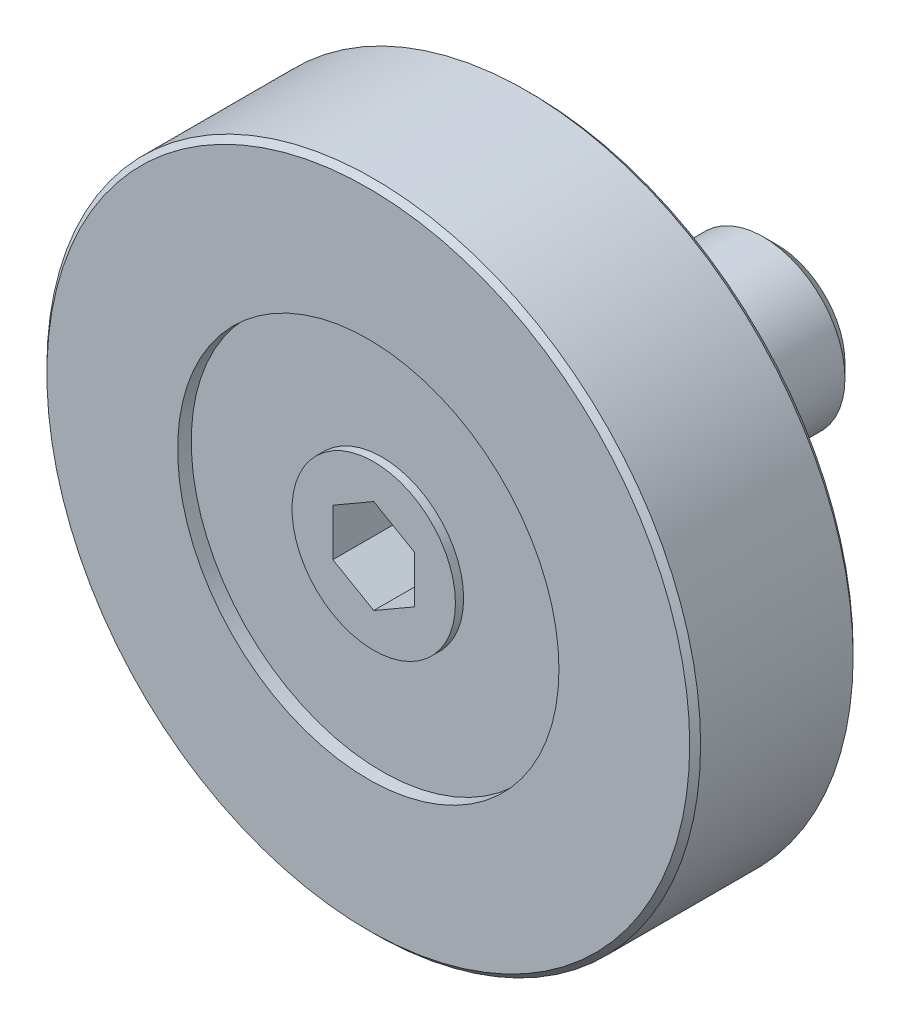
ISO-10303-21;
HEADER;
FILE_DESCRIPTION(('STEP AP214'),'2;1');
FILE_NAME('part.step','',(''),(''),'','','');
FILE_SCHEMA(('AUTOMOTIVE_DESIGN { 1 0 10303 214 1 1 1 1 }'));
ENDSEC;
DATA;
#1=APPLICATION_CONTEXT('core data for automotive mechanical design processes');
#2=APPLICATION_PROTOCOL_DEFINITION('international standard','automotive_design',2000,#1);
#3=PRODUCT_CONTEXT('',#1,'mechanical');
#4=PRODUCT('Part','Part','',(#3));
#5=PRODUCT_RELATED_PRODUCT_CATEGORY('part','',(#4));
#6=PRODUCT_DEFINITION_FORMATION('','',#4);
#7=PRODUCT_DEFINITION_CONTEXT('part definition',#1,'design');
#8=PRODUCT_DEFINITION('design','',#6,#7);
#9=PRODUCT_DEFINITION_SHAPE('','',#8);
#10=(LENGTH_UNIT() NAMED_UNIT(*) SI_UNIT(.MILLI.,.METRE.));
#11=(NAMED_UNIT(*) PLANE_ANGLE_UNIT() SI_UNIT($,.RADIAN.));
#12=(NAMED_UNIT(*) SI_UNIT($,.STERADIAN.) SOLID_ANGLE_UNIT());
#13=UNCERTAINTY_MEASURE_WITH_UNIT(LENGTH_MEASURE(1.E-05),#10,'distance_accuracy_value','');
#14=(GEOMETRIC_REPRESENTATION_CONTEXT(3) GLOBAL_UNCERTAINTY_ASSIGNED_CONTEXT((#13)) GLOBAL_UNIT_ASSIGNED_CONTEXT((#10,
#11,#12)) REPRESENTATION_CONTEXT('',''));
#15=CARTESIAN_POINT('',(0.,0.,0.));
#16=DIRECTION('',(0.,0.,1.));
#17=DIRECTION('',(1.,0.,0.));
#18=AXIS2_PLACEMENT_3D('',#15,#16,#17);
#19=CARTESIAN_POINT('',(0.,0.,-8.00000000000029));
#20=DIRECTION('',(0.,0.,1.));
#21=DIRECTION('',(1.,0.,0.));
#22=AXIS2_PLACEMENT_3D('',#19,#20,#21);
#23=PLANE('',#22);
#24=CARTESIAN_POINT('',(0.,0.,-8.00000000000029));
#25=DIRECTION('',(0.,0.,1.));
#26=DIRECTION('',(1.,0.,0.));
#27=AXIS2_PLACEMENT_3D('',#24,#25,#26);
#28=CIRCLE('',#27,2.49999999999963);
#29=CARTESIAN_POINT('',(2.49999999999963,0.,-8.00000000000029));
#30=VERTEX_POINT('',#29);
#31=EDGE_CURVE('E9',#30,#30,#28,.T.);
#32=ORIENTED_EDGE('',*,*,#31,.F.);
#33=EDGE_LOOP('',(#32));
#34=FACE_BOUND('',#33,.T.);
#35=ADVANCED_FACE('F14',(#34),#23,.F.);
#36=CARTESIAN_POINT('',(0.,0.,-8.00000000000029));
#37=DIRECTION('',(0.,0.,1.));
#38=DIRECTION('',(1.,0.,0.));
#39=AXIS2_PLACEMENT_3D('',#36,#37,#38);
#40=CONICAL_SURFACE('',#39,2.49999999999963,0.785398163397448);
#41=CARTESIAN_POINT('',(0.,0.,-7.50000000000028));
#42=DIRECTION('',(0.,0.,1.));
#43=DIRECTION('',(1.,0.,0.));
#44=AXIS2_PLACEMENT_3D('',#41,#42,#43);
#45=CIRCLE('',#44,2.99999999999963);
#46=CARTESIAN_POINT('',(2.99999999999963,0.,-7.50000000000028));
#47=VERTEX_POINT('',#46);
#48=EDGE_CURVE('E21',#47,#47,#45,.T.);
#49=ORIENTED_EDGE('',*,*,#48,.F.);
#50=EDGE_LOOP('',(#49));
#51=FACE_BOUND('',#50,.T.);
#52=ORIENTED_EDGE('',*,*,#31,.T.);
#53=EDGE_LOOP('',(#52));
#54=FACE_BOUND('',#53,.T.);
#55=ADVANCED_FACE('F169',(#51,#54),#40,.T.);
#56=CARTESIAN_POINT('',(0.,0.,10.));
#57=DIRECTION('',(0.,0.,1.));
#58=DIRECTION('',(1.,0.,0.));
#59=AXIS2_PLACEMENT_3D('',#56,#57,#58);
#60=CYLINDRICAL_SURFACE('',#59,2.99999999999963);
#61=CARTESIAN_POINT('',(0.,0.,-2.00000000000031));
#62=DIRECTION('',(0.,0.,1.));
#63=DIRECTION('',(1.,0.,0.));
#64=AXIS2_PLACEMENT_3D('',#61,#62,#63);
#65=CIRCLE('',#64,2.99999999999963);
#66=CARTESIAN_POINT('',(2.99999999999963,0.,-2.00000000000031));
#67=VERTEX_POINT('',#66);
#68=EDGE_CURVE('E162',#67,#67,#65,.T.);
#69=ORIENTED_EDGE('',*,*,#68,.F.);
#70=EDGE_LOOP('',(#69));
#71=FACE_BOUND('',#70,.T.);
#72=ORIENTED_EDGE('',*,*,#48,.T.);
#73=EDGE_LOOP('',(#72));
#74=FACE_BOUND('',#73,.T.);
#75=ADVANCED_FACE('F167',(#71,#74),#60,.T.);
#76=CARTESIAN_POINT('',(0.,2.34999999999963,-2.00000000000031));
#77=DIRECTION('',(0.,0.,-1.));
#78=DIRECTION('',(-1.,0.,0.));
#79=AXIS2_PLACEMENT_3D('',#76,#77,#78);
#80=PLANE('',#79);
#81=CARTESIAN_POINT('',(0.,0.,-2.00000000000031));
#82=DIRECTION('',(0.,0.,1.));
#83=DIRECTION('',(1.,0.,0.));
#84=AXIS2_PLACEMENT_3D('',#81,#82,#83);
#85=CIRCLE('',#84,2.34999999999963);
#86=CARTESIAN_POINT('',(2.34999999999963,0.,-2.00000000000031));
#87=VERTEX_POINT('',#86);
#88=EDGE_CURVE('E159',#87,#87,#85,.T.);
#89=ORIENTED_EDGE('',*,*,#88,.F.);
#90=EDGE_LOOP('',(#89));
#91=FACE_BOUND('',#90,.T.);
#92=ORIENTED_EDGE('',*,*,#68,.T.);
#93=EDGE_LOOP('',(#92));
#94=FACE_BOUND('',#93,.T.);
#95=ADVANCED_FACE('F194',(#91,#94),#80,.F.);
#96=CARTESIAN_POINT('',(0.,0.,10.));
#97=DIRECTION('',(0.,0.,1.));
#98=DIRECTION('',(1.,0.,0.));
#99=AXIS2_PLACEMENT_3D('',#96,#97,#98);
#100=CYLINDRICAL_SURFACE('',#99,2.34999999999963);
#101=CARTESIAN_POINT('',(0.,0.,-3.05311331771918E-13));
#102=DIRECTION('',(0.,0.,1.));
#103=DIRECTION('',(1.,0.,0.));
#104=AXIS2_PLACEMENT_3D('',#101,#102,#103);
#105=CIRCLE('',#104,2.34999999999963);
#106=CARTESIAN_POINT('',(2.34999999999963,0.,-3.05311331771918E-13));
#107=VERTEX_POINT('',#106);
#108=EDGE_CURVE('E156',#107,#107,#105,.T.);
#109=ORIENTED_EDGE('',*,*,#108,.F.);
#110=EDGE_LOOP('',(#109));
#111=FACE_BOUND('',#110,.T.);
#112=ORIENTED_EDGE('',*,*,#88,.T.);
#113=EDGE_LOOP('',(#112));
#114=FACE_BOUND('',#113,.T.);
#115=ADVANCED_FACE('F203',(#111,#114),#100,.T.);
#116=CARTESIAN_POINT('',(0.,3.99999999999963,-3.05311331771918E-13));
#117=DIRECTION('',(0.,0.,1.));
#118=DIRECTION('',(1.,0.,0.));
#119=AXIS2_PLACEMENT_3D('',#116,#117,#118);
#120=PLANE('',#119);
#121=CARTESIAN_POINT('',(0.,0.,-3.05311331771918E-13));
#122=DIRECTION('',(0.,0.,1.));
#123=DIRECTION('',(1.,0.,0.));
#124=AXIS2_PLACEMENT_3D('',#121,#122,#123);
#125=CIRCLE('',#124,3.99999999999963);
#126=CARTESIAN_POINT('',(3.99999999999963,0.,-3.05311331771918E-13));
#127=VERTEX_POINT('',#126);
#128=EDGE_CURVE('E153',#127,#127,#125,.T.);
#129=ORIENTED_EDGE('',*,*,#128,.F.);
#130=EDGE_LOOP('',(#129));
#131=FACE_BOUND('',#130,.T.);
#132=ORIENTED_EDGE('',*,*,#108,.T.);
#133=EDGE_LOOP('',(#132));
#134=FACE_BOUND('',#133,.T.);
#135=ADVANCED_FACE('F212',(#131,#134),#120,.F.);
#136=CARTESIAN_POINT('',(0.,0.,10.));
#137=DIRECTION('',(0.,0.,1.));
#138=DIRECTION('',(1.,0.,0.));
#139=AXIS2_PLACEMENT_3D('',#136,#137,#138);
#140=CYLINDRICAL_SURFACE('',#139,3.99999999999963);
#141=CARTESIAN_POINT('',(0.,0.,1.49999999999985));
#142=DIRECTION('',(0.,0.,1.));
#143=DIRECTION('',(1.,0.,0.));
#144=AXIS2_PLACEMENT_3D('',#141,#142,#143);
#145=CIRCLE('',#144,3.99999999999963);
#146=CARTESIAN_POINT('',(3.99999999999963,0.,1.49999999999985));
#147=VERTEX_POINT('',#146);
#148=EDGE_CURVE('E150',#147,#147,#145,.T.);
#149=ORIENTED_EDGE('',*,*,#148,.F.);
#150=EDGE_LOOP('',(#149));
#151=FACE_BOUND('',#150,.T.);
#152=ORIENTED_EDGE('',*,*,#128,.T.);
#153=EDGE_LOOP('',(#152));
#154=FACE_BOUND('',#153,.T.);
#155=ADVANCED_FACE('F221',(#151,#154),#140,.T.);
#156=CARTESIAN_POINT('',(0.,3.99999999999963,1.49999999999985));
#157=DIRECTION('',(0.,0.,1.));
#158=DIRECTION('',(1.,0.,0.));
#159=AXIS2_PLACEMENT_3D('',#156,#157,#158);
#160=PLANE('',#159);
#161=CARTESIAN_POINT('',(0.,0.,1.49999999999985));
#162=DIRECTION('',(0.,0.,1.));
#163=DIRECTION('',(1.,0.,0.));
#164=AXIS2_PLACEMENT_3D('',#161,#162,#163);
#165=CIRCLE('',#164,6.99999999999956);
#166=CARTESIAN_POINT('',(6.99999999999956,0.,1.49999999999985));
#167=VERTEX_POINT('',#166);
#168=EDGE_CURVE('E147',#167,#167,#165,.T.);
#169=ORIENTED_EDGE('',*,*,#168,.F.);
#170=EDGE_LOOP('',(#169));
#171=FACE_BOUND('',#170,.T.);
#172=ORIENTED_EDGE('',*,*,#148,.T.);
#173=EDGE_LOOP('',(#172));
#174=FACE_BOUND('',#173,.T.);
#175=ADVANCED_FACE('F230',(#171,#174),#160,.F.);
#176=CARTESIAN_POINT('',(0.,0.,10.));
#177=DIRECTION('',(0.,0.,1.));
#178=DIRECTION('',(1.,0.,0.));
#179=AXIS2_PLACEMENT_3D('',#176,#177,#178);
#180=CYLINDRICAL_SURFACE('',#179,6.99999999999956);
#181=CARTESIAN_POINT('',(0.,0.,0.999999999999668));
#182=DIRECTION('',(0.,0.,1.));
#183=DIRECTION('',(1.,0.,0.));
#184=AXIS2_PLACEMENT_3D('',#181,#182,#183);
#185=CIRCLE('',#184,6.99999999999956);
#186=CARTESIAN_POINT('',(6.99999999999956,0.,0.999999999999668));
#187=VERTEX_POINT('',#186);
#188=EDGE_CURVE('E144',#187,#187,#185,.T.);
#189=ORIENTED_EDGE('',*,*,#188,.F.);
#190=EDGE_LOOP('',(#189));
#191=FACE_BOUND('',#190,.T.);
#192=ORIENTED_EDGE('',*,*,#168,.T.);
#193=EDGE_LOOP('',(#192));
#194=FACE_BOUND('',#193,.T.);
#195=ADVANCED_FACE('F239',(#191,#194),#180,.F.);
#196=CARTESIAN_POINT('',(0.,11.8,0.999999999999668));
#197=DIRECTION('',(0.,0.,1.));
#198=DIRECTION('',(1.,0.,0.));
#199=AXIS2_PLACEMENT_3D('',#196,#197,#198);
#200=PLANE('',#199);
#201=CARTESIAN_POINT('',(0.,0.,0.999999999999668));
#202=DIRECTION('',(0.,0.,1.));
#203=DIRECTION('',(1.,0.,0.));
#204=AXIS2_PLACEMENT_3D('',#201,#202,#203);
#205=CIRCLE('',#204,11.8);
#206=CARTESIAN_POINT('',(11.8,0.,0.999999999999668));
#207=VERTEX_POINT('',#206);
#208=EDGE_CURVE('E141',#207,#207,#205,.T.);
#209=ORIENTED_EDGE('',*,*,#208,.F.);
#210=EDGE_LOOP('',(#209));
#211=FACE_BOUND('',#210,.T.);
#212=ORIENTED_EDGE('',*,*,#188,.T.);
#213=EDGE_LOOP('',(#212));
#214=FACE_BOUND('',#213,.T.);
#215=ADVANCED_FACE('F248',(#211,#214),#200,.F.);
#216=CARTESIAN_POINT('',(0.,0.,0.999999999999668));
#217=DIRECTION('',(0.,0.,1.));
#218=DIRECTION('',(1.,0.,0.));
#219=AXIS2_PLACEMENT_3D('',#216,#217,#218);
#220=CONICAL_SURFACE('',#219,11.8,0.785398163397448);
#221=CARTESIAN_POINT('',(0.,0.,1.19999999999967));
#222=DIRECTION('',(0.,0.,1.));
#223=DIRECTION('',(1.,0.,0.));
#224=AXIS2_PLACEMENT_3D('',#221,#222,#223);
#225=CIRCLE('',#224,12.);
#226=CARTESIAN_POINT('',(12.,0.,1.19999999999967));
#227=VERTEX_POINT('',#226);
#228=EDGE_CURVE('E138',#227,#227,#225,.T.);
#229=ORIENTED_EDGE('',*,*,#228,.F.);
#230=EDGE_LOOP('',(#229));
#231=FACE_BOUND('',#230,.T.);
#232=ORIENTED_EDGE('',*,*,#208,.T.);
#233=EDGE_LOOP('',(#232));
#234=FACE_BOUND('',#233,.T.);
#235=ADVANCED_FACE('F257',(#231,#234),#220,.T.);
#236=CARTESIAN_POINT('',(0.,0.,10.));
#237=DIRECTION('',(0.,0.,1.));
#238=DIRECTION('',(1.,0.,0.));
#239=AXIS2_PLACEMENT_3D('',#236,#237,#238);
#240=CYLINDRICAL_SURFACE('',#239,12.);
#241=CARTESIAN_POINT('',(0.,0.,6.8));
#242=DIRECTION('',(0.,0.,1.));
#243=DIRECTION('',(1.,0.,0.));
#244=AXIS2_PLACEMENT_3D('',#241,#242,#243);
#245=CIRCLE('',#244,12.);
#246=CARTESIAN_POINT('',(12.,0.,6.8));
#247=VERTEX_POINT('',#246);
#248=EDGE_CURVE('E135',#247,#247,#245,.T.);
#249=ORIENTED_EDGE('',*,*,#248,.F.);
#250=EDGE_LOOP('',(#249));
#251=FACE_BOUND('',#250,.T.);
#252=ORIENTED_EDGE('',*,*,#228,.T.);
#253=EDGE_LOOP('',(#252));
#254=FACE_BOUND('',#253,.T.);
#255=ADVANCED_FACE('F266',(#251,#254),#240,.T.);
#256=CARTESIAN_POINT('',(0.,0.,6.8));
#257=DIRECTION('',(0.,0.,-1.));
#258=DIRECTION('',(-1.,0.,0.));
#259=AXIS2_PLACEMENT_3D('',#256,#257,#258);
#260=CONICAL_SURFACE('',#259,12.,0.78539816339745);
#261=CARTESIAN_POINT('',(0.,0.,7.));
#262=DIRECTION('',(0.,0.,1.));
#263=DIRECTION('',(1.,0.,0.));
#264=AXIS2_PLACEMENT_3D('',#261,#262,#263);
#265=CIRCLE('',#264,11.8);
#266=CARTESIAN_POINT('',(11.8,0.,7.));
#267=VERTEX_POINT('',#266);
#268=EDGE_CURVE('E132',#267,#267,#265,.T.);
#269=ORIENTED_EDGE('',*,*,#268,.F.);
#270=EDGE_LOOP('',(#269));
#271=FACE_BOUND('',#270,.T.);
#272=ORIENTED_EDGE('',*,*,#248,.T.);
#273=EDGE_LOOP('',(#272));
#274=FACE_BOUND('',#273,.T.);
#275=ADVANCED_FACE('F275',(#271,#274),#260,.T.);
#276=CARTESIAN_POINT('',(0.,11.8,7.));
#277=DIRECTION('',(0.,0.,-1.));
#278=DIRECTION('',(-1.,0.,0.));
#279=AXIS2_PLACEMENT_3D('',#276,#277,#278);
#280=PLANE('',#279);
#281=CARTESIAN_POINT('',(0.,0.,7.));
#282=DIRECTION('',(0.,0.,1.));
#283=DIRECTION('',(1.,0.,0.));
#284=AXIS2_PLACEMENT_3D('',#281,#282,#283);
#285=CIRCLE('',#284,6.99999999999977);
#286=CARTESIAN_POINT('',(6.99999999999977,0.,7.));
#287=VERTEX_POINT('',#286);
#288=EDGE_CURVE('E129',#287,#287,#285,.T.);
#289=ORIENTED_EDGE('',*,*,#288,.F.);
#290=EDGE_LOOP('',(#289));
#291=FACE_BOUND('',#290,.T.);
#292=ORIENTED_EDGE('',*,*,#268,.T.);
#293=EDGE_LOOP('',(#292));
#294=FACE_BOUND('',#293,.T.);
#295=ADVANCED_FACE('F284',(#291,#294),#280,.F.);
#296=CARTESIAN_POINT('',(0.,0.,10.));
#297=DIRECTION('',(0.,0.,1.));
#298=DIRECTION('',(1.,0.,0.));
#299=AXIS2_PLACEMENT_3D('',#296,#297,#298);
#300=CYLINDRICAL_SURFACE('',#299,6.99999999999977);
#301=CARTESIAN_POINT('',(0.,0.,6.5));
#302=DIRECTION('',(0.,0.,1.));
#303=DIRECTION('',(1.,0.,0.));
#304=AXIS2_PLACEMENT_3D('',#301,#302,#303);
#305=CIRCLE('',#304,6.99999999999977);
#306=CARTESIAN_POINT('',(6.99999999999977,0.,6.5));
#307=VERTEX_POINT('',#306);
#308=EDGE_CURVE('E126',#307,#307,#305,.T.);
#309=ORIENTED_EDGE('',*,*,#308,.F.);
#310=EDGE_LOOP('',(#309));
#311=FACE_BOUND('',#310,.T.);
#312=ORIENTED_EDGE('',*,*,#288,.T.);
#313=EDGE_LOOP('',(#312));
#314=FACE_BOUND('',#313,.T.);
#315=ADVANCED_FACE('F293',(#311,#314),#300,.F.);
#316=CARTESIAN_POINT('',(0.,3.,6.5));
#317=DIRECTION('',(0.,0.,-1.));
#318=DIRECTION('',(-1.,0.,0.));
#319=AXIS2_PLACEMENT_3D('',#316,#317,#318);
#320=PLANE('',#319);
#321=CARTESIAN_POINT('',(0.,0.,6.5));
#322=DIRECTION('',(0.,0.,1.));
#323=DIRECTION('',(1.,0.,0.));
#324=AXIS2_PLACEMENT_3D('',#321,#322,#323);
#325=CIRCLE('',#324,3.);
#326=CARTESIAN_POINT('',(3.,0.,6.5));
#327=VERTEX_POINT('',#326);
#328=EDGE_CURVE('E123',#327,#327,#325,.T.);
#329=ORIENTED_EDGE('',*,*,#328,.F.);
#330=EDGE_LOOP('',(#329));
#331=FACE_BOUND('',#330,.T.);
#332=ORIENTED_EDGE('',*,*,#308,.T.);
#333=EDGE_LOOP('',(#332));
#334=FACE_BOUND('',#333,.T.);
#335=ADVANCED_FACE('F302',(#331,#334),#320,.F.);
#336=CARTESIAN_POINT('',(0.,0.,10.));
#337=DIRECTION('',(0.,0.,1.));
#338=DIRECTION('',(1.,0.,0.));
#339=AXIS2_PLACEMENT_3D('',#336,#337,#338);
#340=CYLINDRICAL_SURFACE('',#339,3.);
#341=CARTESIAN_POINT('',(0.,0.,6.8));
#342=DIRECTION('',(0.,0.,1.));
#343=DIRECTION('',(1.,0.,0.));
#344=AXIS2_PLACEMENT_3D('',#341,#342,#343);
#345=CIRCLE('',#344,3.);
#346=CARTESIAN_POINT('',(3.,0.,6.8));
#347=VERTEX_POINT('',#346);
#348=EDGE_CURVE('E115',#347,#347,#345,.T.);
#349=ORIENTED_EDGE('',*,*,#348,.F.);
#350=EDGE_LOOP('',(#349));
#351=FACE_BOUND('',#350,.T.);
#352=ORIENTED_EDGE('',*,*,#328,.T.);
#353=EDGE_LOOP('',(#352));
#354=FACE_BOUND('',#353,.T.);
#355=ADVANCED_FACE('F311',(#351,#354),#340,.T.);
#356=CARTESIAN_POINT('',(0.,3.,6.8));
#357=DIRECTION('',(0.,0.,-1.));
#358=DIRECTION('',(-1.,0.,0.));
#359=AXIS2_PLACEMENT_3D('',#356,#357,#358);
#360=PLANE('',#359);
#361=DIRECTION('',(-0.866025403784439,-0.5,0.));
#362=VECTOR('',#361,1.);
#363=CARTESIAN_POINT('',(0.,1.73205080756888,6.8));
#364=LINE('',#363,#362);
#365=CARTESIAN_POINT('',(0.,1.73205080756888,6.8));
#366=VERTEX_POINT('',#365);
#367=CARTESIAN_POINT('',(-1.5,0.86602540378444,6.8));
#368=VERTEX_POINT('',#367);
#369=EDGE_CURVE('E102',#366,#368,#364,.T.);
#370=ORIENTED_EDGE('',*,*,#369,.F.);
#371=DIRECTION('',(-0.866025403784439,0.5,0.));
#372=VECTOR('',#371,1.);
#373=CARTESIAN_POINT('',(1.5,0.86602540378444,6.8));
#374=LINE('',#373,#372);
#375=CARTESIAN_POINT('',(1.5,0.86602540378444,6.8));
#376=VERTEX_POINT('',#375);
#377=EDGE_CURVE('E28',#376,#366,#374,.T.);
#378=ORIENTED_EDGE('',*,*,#377,.F.);
#379=DIRECTION('',(0.,1.,0.));
#380=VECTOR('',#379,1.);
#381=CARTESIAN_POINT('',(1.5,-0.866025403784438,6.8));
#382=LINE('',#381,#380);
#383=CARTESIAN_POINT('',(1.5,-0.866025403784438,6.8));
#384=VERTEX_POINT('',#383);
#385=EDGE_CURVE('E111',#384,#376,#382,.T.);
#386=ORIENTED_EDGE('',*,*,#385,.F.);
#387=DIRECTION('',(0.866025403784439,0.5,0.));
#388=VECTOR('',#387,1.);
#389=CARTESIAN_POINT('',(0.,-1.73205080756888,6.8));
#390=LINE('',#389,#388);
#391=CARTESIAN_POINT('',(0.,-1.73205080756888,6.8));
#392=VERTEX_POINT('',#391);
#393=EDGE_CURVE('E109',#392,#384,#390,.T.);
#394=ORIENTED_EDGE('',*,*,#393,.F.);
#395=DIRECTION('',(0.866025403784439,-0.5,0.));
#396=VECTOR('',#395,1.);
#397=CARTESIAN_POINT('',(-1.5,-0.866025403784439,6.8));
#398=LINE('',#397,#396);
#399=CARTESIAN_POINT('',(-1.5,-0.866025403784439,6.8));
#400=VERTEX_POINT('',#399);
#401=EDGE_CURVE('E76',#400,#392,#398,.T.);
#402=ORIENTED_EDGE('',*,*,#401,.F.);
#403=DIRECTION('',(0.,-1.,0.));
#404=VECTOR('',#403,1.);
#405=CARTESIAN_POINT('',(-1.5,0.86602540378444,6.8));
#406=LINE('',#405,#404);
#407=EDGE_CURVE('E105',#368,#400,#406,.T.);
#408=ORIENTED_EDGE('',*,*,#407,.F.);
#409=EDGE_LOOP('',(#370,#378,#386,#394,#402,#408));
#410=FACE_BOUND('',#409,.T.);
#411=ORIENTED_EDGE('',*,*,#348,.T.);
#412=EDGE_LOOP('',(#411));
#413=FACE_BOUND('',#412,.T.);
#414=ADVANCED_FACE('F320',(#410,#413),#360,.F.);
#415=CARTESIAN_POINT('',(1.5,0.86602540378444,4.3));
#416=DIRECTION('',(0.5,0.866025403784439,0.));
#417=DIRECTION('',(-0.866025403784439,0.5,0.));
#418=AXIS2_PLACEMENT_3D('',#415,#416,#417);
#419=PLANE('',#418);
#420=ORIENTED_EDGE('',*,*,#377,.T.);
#421=DIRECTION('',(0.,0.,1.));
#422=VECTOR('',#421,1.);
#423=CARTESIAN_POINT('',(0.,1.73205080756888,4.3));
#424=LINE('',#423,#422);
#425=CARTESIAN_POINT('',(0.,1.73205080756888,4.3));
#426=VERTEX_POINT('',#425);
#427=EDGE_CURVE('E58',#426,#366,#424,.T.);
#428=ORIENTED_EDGE('',*,*,#427,.F.);
#429=DIRECTION('',(-0.866025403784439,0.5,0.));
#430=VECTOR('',#429,1.);
#431=CARTESIAN_POINT('',(1.5,0.86602540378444,4.3));
#432=LINE('',#431,#430);
#433=CARTESIAN_POINT('',(1.5,0.86602540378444,4.3));
#434=VERTEX_POINT('',#433);
#435=EDGE_CURVE('E113',#434,#426,#432,.T.);
#436=ORIENTED_EDGE('',*,*,#435,.F.);
#437=DIRECTION('',(0.,0.,1.));
#438=VECTOR('',#437,1.);
#439=CARTESIAN_POINT('',(1.5,0.86602540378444,4.3));
#440=LINE('',#439,#438);
#441=EDGE_CURVE('E36',#434,#376,#440,.T.);
#442=ORIENTED_EDGE('',*,*,#441,.T.);
#443=EDGE_LOOP('',(#420,#428,#436,#442));
#444=FACE_BOUND('',#443,.T.);
#445=ADVANCED_FACE('F329',(#444),#419,.F.);
#446=CARTESIAN_POINT('',(1.5,-0.866025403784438,4.3));
#447=DIRECTION('',(1.,0.,0.));
#448=DIRECTION('',(0.,1.,0.));
#449=AXIS2_PLACEMENT_3D('',#446,#447,#448);
#450=PLANE('',#449);
#451=ORIENTED_EDGE('',*,*,#385,.T.);
#452=ORIENTED_EDGE('',*,*,#441,.F.);
#453=DIRECTION('',(0.,1.,0.));
#454=VECTOR('',#453,1.);
#455=CARTESIAN_POINT('',(1.5,-0.866025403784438,4.3));
#456=LINE('',#455,#454);
#457=CARTESIAN_POINT('',(1.5,-0.866025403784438,4.3));
#458=VERTEX_POINT('',#457);
#459=EDGE_CURVE('E88',#458,#434,#456,.T.);
#460=ORIENTED_EDGE('',*,*,#459,.F.);
#461=DIRECTION('',(0.,0.,1.));
#462=VECTOR('',#461,1.);
#463=CARTESIAN_POINT('',(1.5,-0.866025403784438,4.3));
#464=LINE('',#463,#462);
#465=EDGE_CURVE('E80',#458,#384,#464,.T.);
#466=ORIENTED_EDGE('',*,*,#465,.T.);
#467=EDGE_LOOP('',(#451,#452,#460,#466));
#468=FACE_BOUND('',#467,.T.);
#469=ADVANCED_FACE('F338',(#468),#450,.F.);
#470=CARTESIAN_POINT('',(0.,-1.73205080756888,4.3));
#471=DIRECTION('',(0.5,-0.866025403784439,0.));
#472=DIRECTION('',(0.866025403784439,0.5,0.));
#473=AXIS2_PLACEMENT_3D('',#470,#471,#472);
#474=PLANE('',#473);
#475=ORIENTED_EDGE('',*,*,#393,.T.);
#476=ORIENTED_EDGE('',*,*,#465,.F.);
#477=DIRECTION('',(0.866025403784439,0.5,0.));
#478=VECTOR('',#477,1.);
#479=CARTESIAN_POINT('',(0.,-1.73205080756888,4.3));
#480=LINE('',#479,#478);
#481=CARTESIAN_POINT('',(0.,-1.73205080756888,4.3));
#482=VERTEX_POINT('',#481);
#483=EDGE_CURVE('E84',#482,#458,#480,.T.);
#484=ORIENTED_EDGE('',*,*,#483,.F.);
#485=DIRECTION('',(0.,0.,1.));
#486=VECTOR('',#485,1.);
#487=CARTESIAN_POINT('',(0.,-1.73205080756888,4.3));
#488=LINE('',#487,#486);
#489=EDGE_CURVE('E69',#482,#392,#488,.T.);
#490=ORIENTED_EDGE('',*,*,#489,.T.);
#491=EDGE_LOOP('',(#475,#476,#484,#490));
#492=FACE_BOUND('',#491,.T.);
#493=ADVANCED_FACE('F85',(#492),#474,.F.);
#494=CARTESIAN_POINT('',(-1.5,-0.866025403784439,4.3));
#495=DIRECTION('',(-0.5,-0.866025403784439,0.));
#496=DIRECTION('',(0.866025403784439,-0.5,0.));
#497=AXIS2_PLACEMENT_3D('',#494,#495,#496);
#498=PLANE('',#497);
#499=ORIENTED_EDGE('',*,*,#401,.T.);
#500=ORIENTED_EDGE('',*,*,#489,.F.);
#501=DIRECTION('',(0.866025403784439,-0.5,0.));
#502=VECTOR('',#501,1.);
#503=CARTESIAN_POINT('',(-1.5,-0.866025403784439,4.3));
#504=LINE('',#503,#502);
#505=CARTESIAN_POINT('',(-1.5,-0.866025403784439,4.3));
#506=VERTEX_POINT('',#505);
#507=EDGE_CURVE('E73',#506,#482,#504,.T.);
#508=ORIENTED_EDGE('',*,*,#507,.F.);
#509=DIRECTION('',(0.,0.,1.));
#510=VECTOR('',#509,1.);
#511=CARTESIAN_POINT('',(-1.5,-0.866025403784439,4.3));
#512=LINE('',#511,#510);
#513=EDGE_CURVE('E81',#506,#400,#512,.T.);
#514=ORIENTED_EDGE('',*,*,#513,.T.);
#515=EDGE_LOOP('',(#499,#500,#508,#514));
#516=FACE_BOUND('',#515,.T.);
#517=ADVANCED_FACE('F71',(#516),#498,.F.);
#518=CARTESIAN_POINT('',(-1.5,0.86602540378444,4.3));
#519=DIRECTION('',(-1.,0.,0.));
#520=DIRECTION('',(0.,-1.,0.));
#521=AXIS2_PLACEMENT_3D('',#518,#519,#520);
#522=PLANE('',#521);
#523=ORIENTED_EDGE('',*,*,#407,.T.);
#524=ORIENTED_EDGE('',*,*,#513,.F.);
#525=DIRECTION('',(0.,-1.,0.));
#526=VECTOR('',#525,1.);
#527=CARTESIAN_POINT('',(-1.5,0.86602540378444,4.3));
#528=LINE('',#527,#526);
#529=CARTESIAN_POINT('',(-1.5,0.86602540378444,4.3));
#530=VERTEX_POINT('',#529);
#531=EDGE_CURVE('E94',#530,#506,#528,.T.);
#532=ORIENTED_EDGE('',*,*,#531,.F.);
#533=DIRECTION('',(0.,0.,1.));
#534=VECTOR('',#533,1.);
#535=CARTESIAN_POINT('',(-1.5,0.86602540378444,4.3));
#536=LINE('',#535,#534);
#537=EDGE_CURVE('E118',#530,#368,#536,.T.);
#538=ORIENTED_EDGE('',*,*,#537,.T.);
#539=EDGE_LOOP('',(#523,#524,#532,#538));
#540=FACE_BOUND('',#539,.T.);
#541=ADVANCED_FACE('F360',(#540),#522,.F.);
#542=CARTESIAN_POINT('',(0.,1.73205080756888,4.3));
#543=DIRECTION('',(-0.5,0.866025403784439,0.));
#544=DIRECTION('',(-0.866025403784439,-0.5,0.));
#545=AXIS2_PLACEMENT_3D('',#542,#543,#544);
#546=PLANE('',#545);
#547=ORIENTED_EDGE('',*,*,#369,.T.);
#548=ORIENTED_EDGE('',*,*,#537,.F.);
#549=DIRECTION('',(-0.866025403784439,-0.5,0.));
#550=VECTOR('',#549,1.);
#551=CARTESIAN_POINT('',(0.,1.73205080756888,4.3));
#552=LINE('',#551,#550);
#553=EDGE_CURVE('E96',#426,#530,#552,.T.);
#554=ORIENTED_EDGE('',*,*,#553,.F.);
#555=ORIENTED_EDGE('',*,*,#427,.T.);
#556=EDGE_LOOP('',(#547,#548,#554,#555));
#557=FACE_BOUND('',#556,.T.);
#558=ADVANCED_FACE('F368',(#557),#546,.F.);
#559=CARTESIAN_POINT('',(0.,0.,4.3));
#560=DIRECTION('',(0.,0.,1.));
#561=DIRECTION('',(1.,0.,0.));
#562=AXIS2_PLACEMENT_3D('',#559,#560,#561);
#563=PLANE('',#562);
#564=ORIENTED_EDGE('',*,*,#435,.T.);
#565=ORIENTED_EDGE('',*,*,#553,.T.);
#566=ORIENTED_EDGE('',*,*,#531,.T.);
#567=ORIENTED_EDGE('',*,*,#507,.T.);
#568=ORIENTED_EDGE('',*,*,#483,.T.);
#569=ORIENTED_EDGE('',*,*,#459,.T.);
#570=EDGE_LOOP('',(#564,#565,#566,#567,#568,#569));
#571=FACE_BOUND('',#570,.T.);
#572=ADVANCED_FACE('F91',(#571),#563,.T.);
#573=CLOSED_SHELL('',(#35,#55,#75,#95,#115,#135,#155,#175,#195,#215,#235,#255,#275,#295,#315,
#335,#355,#414,#445,#469,#493,#517,#541,#558,#572));
#574=MANIFOLD_SOLID_BREP('B1',#573);
#575=ADVANCED_BREP_SHAPE_REPRESENTATION('',(#18,#574),#14);
#576=SHAPE_DEFINITION_REPRESENTATION(#9,#575);
ENDSEC;
END-ISO-10303-21;
